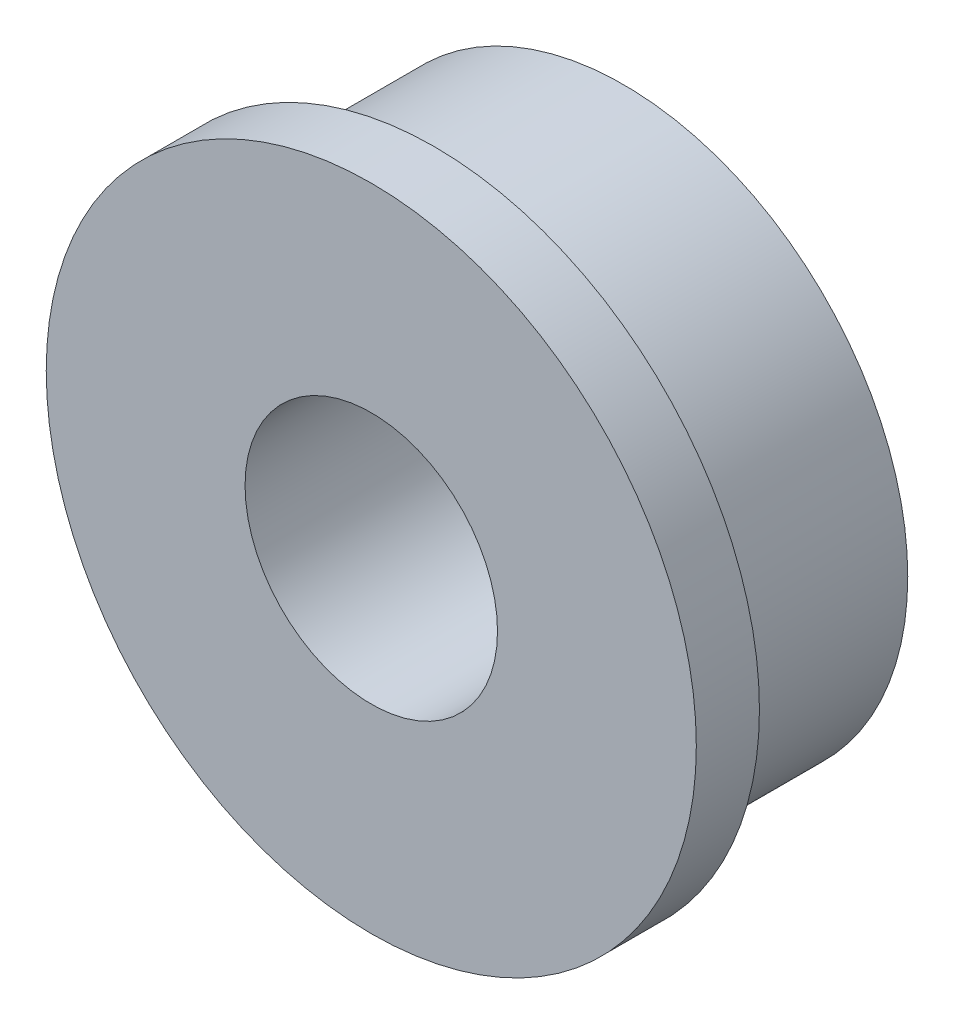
ISO-10303-21;
HEADER;
FILE_DESCRIPTION(('STEP AP214'),'2;1');
FILE_NAME('part.step','',(''),(''),'','','');
FILE_SCHEMA(('AUTOMOTIVE_DESIGN { 1 0 10303 214 1 1 1 1 }'));
ENDSEC;
DATA;
#1=APPLICATION_CONTEXT('core data for automotive mechanical design processes');
#2=APPLICATION_PROTOCOL_DEFINITION('international standard','automotive_design',2000,#1);
#3=PRODUCT_CONTEXT('',#1,'mechanical');
#4=PRODUCT('Part','Part','',(#3));
#5=PRODUCT_RELATED_PRODUCT_CATEGORY('part','',(#4));
#6=PRODUCT_DEFINITION_FORMATION('','',#4);
#7=PRODUCT_DEFINITION_CONTEXT('part definition',#1,'design');
#8=PRODUCT_DEFINITION('design','',#6,#7);
#9=PRODUCT_DEFINITION_SHAPE('','',#8);
#10=(LENGTH_UNIT() NAMED_UNIT(*) SI_UNIT(.MILLI.,.METRE.));
#11=(NAMED_UNIT(*) PLANE_ANGLE_UNIT() SI_UNIT($,.RADIAN.));
#12=(NAMED_UNIT(*) SI_UNIT($,.STERADIAN.) SOLID_ANGLE_UNIT());
#13=UNCERTAINTY_MEASURE_WITH_UNIT(LENGTH_MEASURE(1.E-05),#10,'distance_accuracy_value','');
#14=(GEOMETRIC_REPRESENTATION_CONTEXT(3) GLOBAL_UNCERTAINTY_ASSIGNED_CONTEXT((#13)) GLOBAL_UNIT_ASSIGNED_CONTEXT((#10,
#11,#12)) REPRESENTATION_CONTEXT('',''));
#15=CARTESIAN_POINT('',(0.,0.,0.));
#16=DIRECTION('',(0.,0.,1.));
#17=DIRECTION('',(1.,0.,0.));
#18=AXIS2_PLACEMENT_3D('',#15,#16,#17);
#19=CARTESIAN_POINT('',(0.,0.,4.));
#20=DIRECTION('',(0.,0.,-1.));
#21=DIRECTION('',(-1.,0.,0.));
#22=AXIS2_PLACEMENT_3D('',#19,#20,#21);
#23=CYLINDRICAL_SURFACE('',#22,4.5);
#24=CARTESIAN_POINT('',(0.,0.,0.));
#25=DIRECTION('',(0.,0.,1.));
#26=DIRECTION('',(1.,0.,0.));
#27=AXIS2_PLACEMENT_3D('',#24,#25,#26);
#28=CIRCLE('',#27,4.5);
#29=CARTESIAN_POINT('',(4.5,0.,0.));
#30=VERTEX_POINT('',#29);
#31=EDGE_CURVE('E38',#30,#30,#28,.T.);
#32=ORIENTED_EDGE('',*,*,#31,.T.);
#33=EDGE_LOOP('',(#32));
#34=FACE_BOUND('',#33,.T.);
#35=CARTESIAN_POINT('',(0.,0.,3.));
#36=DIRECTION('',(0.,0.,1.));
#37=DIRECTION('',(1.,0.,0.));
#38=AXIS2_PLACEMENT_3D('',#35,#36,#37);
#39=CIRCLE('',#38,4.5);
#40=CARTESIAN_POINT('',(4.5,0.,3.));
#41=VERTEX_POINT('',#40);
#42=EDGE_CURVE('E10',#41,#41,#39,.T.);
#43=ORIENTED_EDGE('',*,*,#42,.F.);
#44=EDGE_LOOP('',(#43));
#45=FACE_BOUND('',#44,.T.);
#46=ADVANCED_FACE('F32',(#34,#45),#23,.T.);
#47=CARTESIAN_POINT('',(0.,0.,4.));
#48=DIRECTION('',(0.,0.,1.));
#49=DIRECTION('',(1.,0.,0.));
#50=AXIS2_PLACEMENT_3D('',#47,#48,#49);
#51=PLANE('',#50);
#52=CARTESIAN_POINT('',(0.,0.,4.));
#53=DIRECTION('',(0.,0.,1.));
#54=DIRECTION('',(1.,0.,0.));
#55=AXIS2_PLACEMENT_3D('',#52,#53,#54);
#56=CIRCLE('',#55,2.);
#57=CARTESIAN_POINT('',(2.,0.,4.));
#58=VERTEX_POINT('',#57);
#59=EDGE_CURVE('E42',#58,#58,#56,.T.);
#60=ORIENTED_EDGE('',*,*,#59,.F.);
#61=EDGE_LOOP('',(#60));
#62=FACE_BOUND('',#61,.T.);
#63=CARTESIAN_POINT('',(0.,0.,4.));
#64=DIRECTION('',(0.,0.,1.));
#65=DIRECTION('',(1.,0.,0.));
#66=AXIS2_PLACEMENT_3D('',#63,#64,#65);
#67=CIRCLE('',#66,5.15);
#68=CARTESIAN_POINT('',(5.15,0.,4.));
#69=VERTEX_POINT('',#68);
#70=EDGE_CURVE('E52',#69,#69,#67,.T.);
#71=ORIENTED_EDGE('',*,*,#70,.T.);
#72=EDGE_LOOP('',(#71));
#73=FACE_BOUND('',#72,.T.);
#74=ADVANCED_FACE('F70',(#62,#73),#51,.T.);
#75=CARTESIAN_POINT('',(0.,0.,0.));
#76=DIRECTION('',(0.,0.,1.));
#77=DIRECTION('',(1.,0.,0.));
#78=AXIS2_PLACEMENT_3D('',#75,#76,#77);
#79=PLANE('',#78);
#80=ORIENTED_EDGE('',*,*,#31,.F.);
#81=EDGE_LOOP('',(#80));
#82=FACE_BOUND('',#81,.T.);
#83=CARTESIAN_POINT('',(0.,0.,0.));
#84=DIRECTION('',(0.,0.,1.));
#85=DIRECTION('',(1.,0.,0.));
#86=AXIS2_PLACEMENT_3D('',#83,#84,#85);
#87=CIRCLE('',#86,2.);
#88=CARTESIAN_POINT('',(2.,0.,0.));
#89=VERTEX_POINT('',#88);
#90=EDGE_CURVE('E46',#89,#89,#87,.T.);
#91=ORIENTED_EDGE('',*,*,#90,.T.);
#92=EDGE_LOOP('',(#91));
#93=FACE_BOUND('',#92,.T.);
#94=ADVANCED_FACE('F74',(#82,#93),#79,.F.);
#95=CARTESIAN_POINT('',(0.,0.,4.));
#96=DIRECTION('',(0.,0.,-1.));
#97=DIRECTION('',(-1.,0.,0.));
#98=AXIS2_PLACEMENT_3D('',#95,#96,#97);
#99=CYLINDRICAL_SURFACE('',#98,2.);
#100=ORIENTED_EDGE('',*,*,#59,.T.);
#101=EDGE_LOOP('',(#100));
#102=FACE_BOUND('',#101,.T.);
#103=ORIENTED_EDGE('',*,*,#90,.F.);
#104=EDGE_LOOP('',(#103));
#105=FACE_BOUND('',#104,.T.);
#106=ADVANCED_FACE('F67',(#102,#105),#99,.F.);
#107=CARTESIAN_POINT('',(0.,0.,3.));
#108=DIRECTION('',(0.,0.,1.));
#109=DIRECTION('',(1.,0.,0.));
#110=AXIS2_PLACEMENT_3D('',#107,#108,#109);
#111=CYLINDRICAL_SURFACE('',#110,5.15);
#112=CARTESIAN_POINT('',(0.,0.,3.));
#113=DIRECTION('',(0.,0.,1.));
#114=DIRECTION('',(1.,0.,0.));
#115=AXIS2_PLACEMENT_3D('',#112,#113,#114);
#116=CIRCLE('',#115,5.15);
#117=CARTESIAN_POINT('',(5.15,0.,3.));
#118=VERTEX_POINT('',#117);
#119=EDGE_CURVE('E50',#118,#118,#116,.T.);
#120=ORIENTED_EDGE('',*,*,#119,.T.);
#121=EDGE_LOOP('',(#120));
#122=FACE_BOUND('',#121,.T.);
#123=ORIENTED_EDGE('',*,*,#70,.F.);
#124=EDGE_LOOP('',(#123));
#125=FACE_BOUND('',#124,.T.);
#126=ADVANCED_FACE('F58',(#122,#125),#111,.T.);
#127=CARTESIAN_POINT('',(0.,0.,3.));
#128=DIRECTION('',(0.,0.,1.));
#129=DIRECTION('',(1.,0.,0.));
#130=AXIS2_PLACEMENT_3D('',#127,#128,#129);
#131=PLANE('',#130);
#132=ORIENTED_EDGE('',*,*,#42,.T.);
#133=EDGE_LOOP('',(#132));
#134=FACE_BOUND('',#133,.T.);
#135=ORIENTED_EDGE('',*,*,#119,.F.);
#136=EDGE_LOOP('',(#135));
#137=FACE_BOUND('',#136,.T.);
#138=ADVANCED_FACE('F61',(#134,#137),#131,.F.);
#139=CLOSED_SHELL('',(#46,#74,#94,#106,#126,#138));
#140=MANIFOLD_SOLID_BREP('B2',#139);
#141=ADVANCED_BREP_SHAPE_REPRESENTATION('',(#18,#140),#14);
#142=SHAPE_DEFINITION_REPRESENTATION(#9,#141);
ENDSEC;
END-ISO-10303-21;
